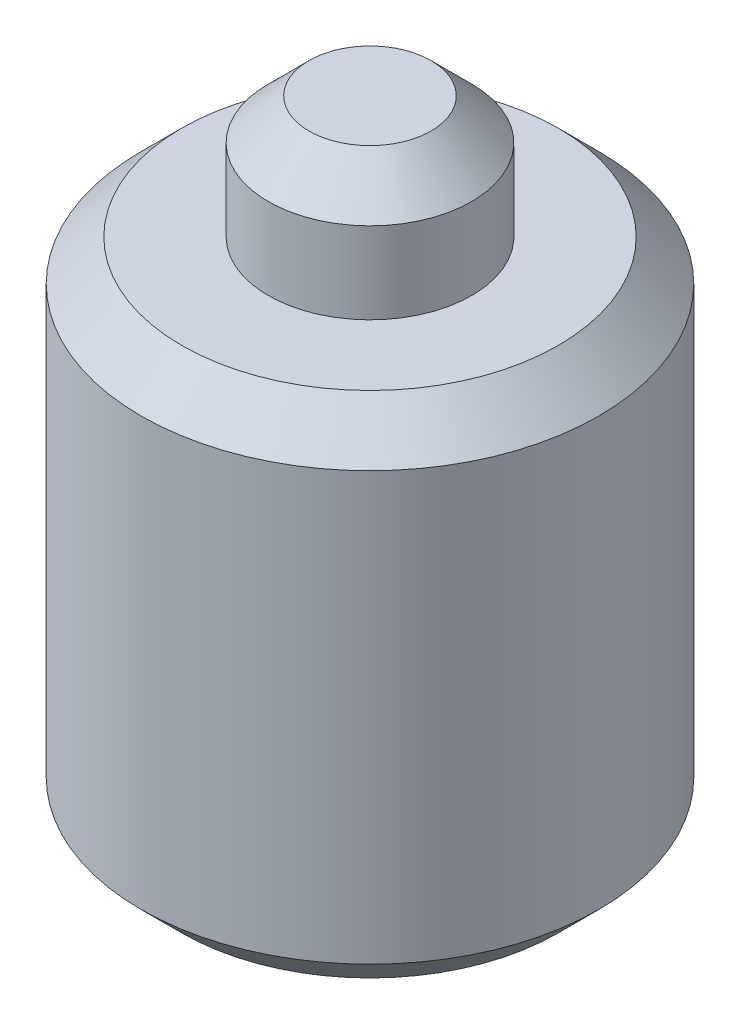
from build123d import *


with BuildPart() as part:
    # Sketch1 → Revolve1 (revolve)
    with BuildSketch(Plane.XY, mode=Mode.PRIVATE) as revolve1_sk:
        Polygon((0, 0), (-2.3495, 0), (-2.8575, 0.508), (-2.8575, 5.842), (-2.3495, 6.35), (-1.27, 6.35), (-1.27, 7.366), (-0.762, 7.874), (0, 7.874), align=None)
    revolve(revolve1_sk.sketch.rotate(Axis((0, 0, 0), (0, 1, 0)), 270), axis=Axis((0, 0, 0), (0, 1, 0)))


solid = part.part
